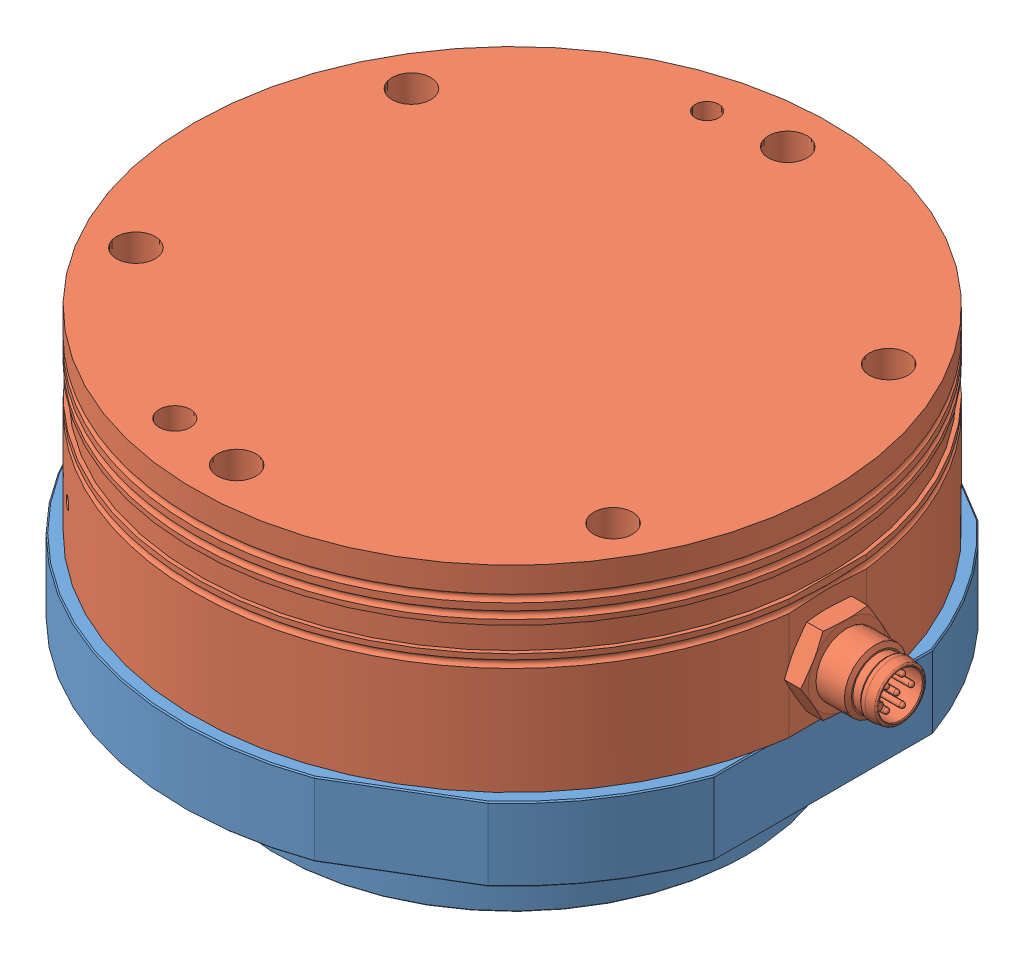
SolidWorks assembly Axia80 And Interface Plate.SLDASM, configuration Default (file format 14000). Lengths in mm.
Overall size (91.2 49.4 85.1).
2 component instances, 2 part files, 7 mates.
Components (placement in the parent):
- 3700-05-2126-1: 3700-05-2126.SLDPRT [Default] at (0 -25.4 0) x (-1 0 0) z (0 1 0) size (80.3 85.1 24)
- ATI-9105-Axia80-M8-1: ATI-9105-Axia80-M8.SLDPRT [Default] at (43.194 -18.433 0) x (0 0 1) z (1 0 0) size (82 25.4 91.2)
Mates (geometry in assembly coordinates):
- Coincident5: coincident anti-aligned: plane of 3700-05-2126-1 through (185.6084 -25.4 0) normal (0 1 0); plane of ATI-9105-Axia80-M8-1 through (185.6084 -25.4 0) normal (0 -1 0)
- Concentric1: concentric aligned: cylinder of 3700-05-2126-1 through (154.8126 -34.9 17.78) axis (0 -1 0) radius 2.75; cylinder of ATI-9105-Axia80-M8-1 through (154.8126 -25.4 17.78) axis (0 -1 0) radius 2.5
- Coincident6: coincident aligned: plane of 3700-05-2126-1 through (185.6084 -25.4 0) normal (0 0 1); plane of ATI-9105-Axia80-M8-1 through (228.8024 -18.433 0) normal (0 0 1)
- Coincident11: coincident: plane of ATI-9105-Axia80-M8-1 through (228.8024 -18.433 0) normal (0 0 1)
- Coincident12: coincident aligned: plane of ATI-9105-Axia80-M8-1 through (185.6084 0 0) normal (0 1 0)
- Coincident13: coincident aligned: plane of ATI-9105-Axia80-M8-1 through (228.8024 -18.433 0) normal (0 0 1)
- Coincident14: coincident: unknown of 3700-05-2126-1
